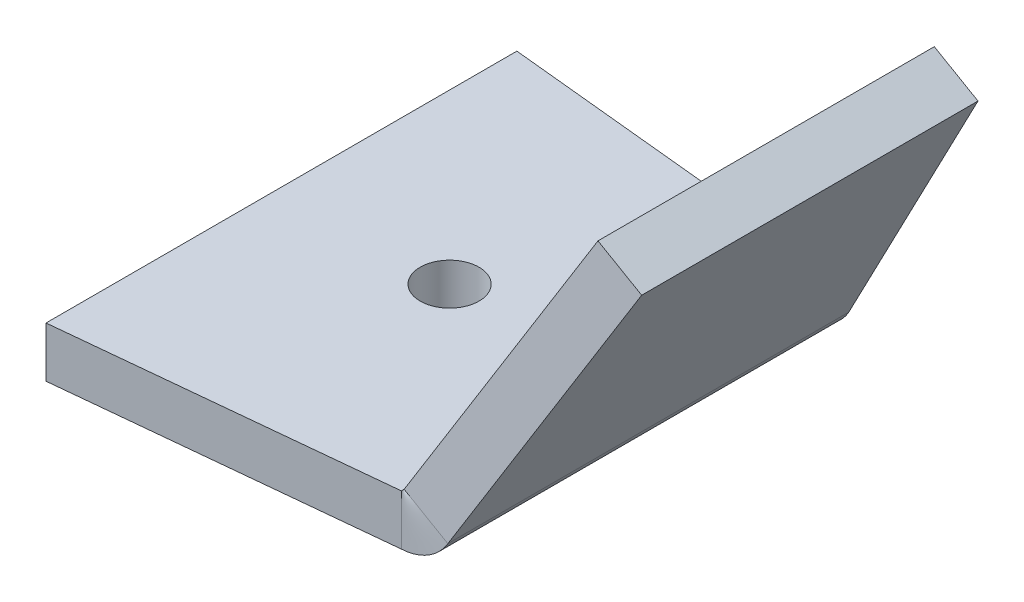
ISO-10303-21;
HEADER;
FILE_DESCRIPTION(('STEP AP214'),'2;1');
FILE_NAME('part.step','',(''),(''),'','','');
FILE_SCHEMA(('AUTOMOTIVE_DESIGN { 1 0 10303 214 1 1 1 1 }'));
ENDSEC;
DATA;
#1=APPLICATION_CONTEXT('core data for automotive mechanical design processes');
#2=APPLICATION_PROTOCOL_DEFINITION('international standard','automotive_design',2000,#1);
#3=PRODUCT_CONTEXT('',#1,'mechanical');
#4=PRODUCT('Part','Part','',(#3));
#5=PRODUCT_RELATED_PRODUCT_CATEGORY('part','',(#4));
#6=PRODUCT_DEFINITION_FORMATION('','',#4);
#7=PRODUCT_DEFINITION_CONTEXT('part definition',#1,'design');
#8=PRODUCT_DEFINITION('design','',#6,#7);
#9=PRODUCT_DEFINITION_SHAPE('','',#8);
#10=(LENGTH_UNIT() NAMED_UNIT(*) SI_UNIT(.MILLI.,.METRE.));
#11=(NAMED_UNIT(*) PLANE_ANGLE_UNIT() SI_UNIT($,.RADIAN.));
#12=(NAMED_UNIT(*) SI_UNIT($,.STERADIAN.) SOLID_ANGLE_UNIT());
#13=UNCERTAINTY_MEASURE_WITH_UNIT(LENGTH_MEASURE(1.E-05),#10,'distance_accuracy_value','');
#14=(GEOMETRIC_REPRESENTATION_CONTEXT(3) GLOBAL_UNCERTAINTY_ASSIGNED_CONTEXT((#13)) GLOBAL_UNIT_ASSIGNED_CONTEXT((#10,
#11,#12)) REPRESENTATION_CONTEXT('',''));
#15=CARTESIAN_POINT('',(0.,0.,0.));
#16=DIRECTION('',(0.,0.,1.));
#17=DIRECTION('',(1.,0.,0.));
#18=AXIS2_PLACEMENT_3D('',#15,#16,#17);
#19=CARTESIAN_POINT('',(28.8227090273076,19.6407988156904,-10.));
#20=DIRECTION('',(-0.0497518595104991,-0.0861727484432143,0.995037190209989));
#21=DIRECTION('',(0.497518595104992,0.861727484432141,0.0995037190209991));
#22=AXIS2_PLACEMENT_3D('',#19,#20,#21);
#23=PLANE('',#22);
#24=DIRECTION('',(-0.497518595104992,-0.861727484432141,-0.0995037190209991));
#25=VECTOR('',#24,1.);
#26=CARTESIAN_POINT('',(31.420785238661,18.1407988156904,-10.));
#27=LINE('',#26,#25);
#28=CARTESIAN_POINT('',(31.420785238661,18.1407988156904,-10.));
#29=VERTEX_POINT('',#28);
#30=CARTESIAN_POINT('',(21.8161023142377,1.50500000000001,-11.9209365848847));
#31=VERTEX_POINT('',#30);
#32=EDGE_CURVE('E76',#29,#31,#27,.T.);
#33=ORIENTED_EDGE('',*,*,#32,.T.);
#34=CARTESIAN_POINT('',(19.2180261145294,3.00499999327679,-11.9209365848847));
#35=CARTESIAN_POINT('',(21.8161023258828,1.50499999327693,-11.9209365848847));
#36=B_SPLINE_CURVE_WITH_KNOTS('',1,(#34,#35),.UNSPECIFIED.,.F.,.F.,(2,2),(0.,1.),.UNSPECIFIED.);
#37=CARTESIAN_POINT('',(19.2180261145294,3.00499999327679,-11.9209365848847));
#38=VERTEX_POINT('',#37);
#39=EDGE_CURVE('E268',#31,#38,#36,.F.);
#40=ORIENTED_EDGE('',*,*,#39,.T.);
#41=DIRECTION('',(-0.497518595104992,-0.861727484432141,-0.0995037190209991));
#42=VECTOR('',#41,1.);
#43=CARTESIAN_POINT('',(28.8227090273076,19.6407988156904,-10.));
#44=LINE('',#43,#42);
#45=CARTESIAN_POINT('',(28.8227090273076,19.6407988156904,-10.));
#46=VERTEX_POINT('',#45);
#47=EDGE_CURVE('E287',#46,#38,#44,.T.);
#48=ORIENTED_EDGE('',*,*,#47,.F.);
#49=DIRECTION('',(0.86602540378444,-0.499999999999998,0.));
#50=VECTOR('',#49,1.);
#51=CARTESIAN_POINT('',(28.8227090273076,19.6407988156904,-10.));
#52=LINE('',#51,#50);
#53=EDGE_CURVE('E295',#46,#29,#52,.T.);
#54=ORIENTED_EDGE('',*,*,#53,.T.);
#55=EDGE_LOOP('',(#33,#40,#48,#54));
#56=FACE_BOUND('',#55,.T.);
#57=ADVANCED_FACE('F50',(#56),#23,.F.);
#58=CARTESIAN_POINT('',(28.8227090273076,19.6407988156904,10.));
#59=DIRECTION('',(-0.0497518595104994,-0.0861727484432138,-0.995037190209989));
#60=DIRECTION('',(-0.497518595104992,-0.861727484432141,0.0995037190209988));
#61=AXIS2_PLACEMENT_3D('',#58,#59,#60);
#62=PLANE('',#61);
#63=DIRECTION('',(0.497518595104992,0.861727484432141,-0.0995037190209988));
#64=VECTOR('',#63,1.);
#65=CARTESIAN_POINT('',(28.8227090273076,19.6407988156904,10.));
#66=LINE('',#65,#64);
#67=CARTESIAN_POINT('',(19.2180261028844,3.005,11.9209365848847));
#68=VERTEX_POINT('',#67);
#69=CARTESIAN_POINT('',(28.8227090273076,19.6407988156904,10.));
#70=VERTEX_POINT('',#69);
#71=EDGE_CURVE('E283',#68,#70,#66,.T.);
#72=ORIENTED_EDGE('',*,*,#71,.F.);
#73=CARTESIAN_POINT('',(21.8161023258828,1.50499999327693,11.9209365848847));
#74=CARTESIAN_POINT('',(19.2180261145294,3.00499999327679,11.9209365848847));
#75=B_SPLINE_CURVE_WITH_KNOTS('',1,(#73,#74),.UNSPECIFIED.,.F.,.F.,(2,2),(0.,1.),.UNSPECIFIED.);
#76=CARTESIAN_POINT('',(21.8161023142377,1.505,11.9209365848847));
#77=VERTEX_POINT('',#76);
#78=EDGE_CURVE('E12',#68,#77,#75,.F.);
#79=ORIENTED_EDGE('',*,*,#78,.T.);
#80=DIRECTION('',(0.497518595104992,0.861727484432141,-0.0995037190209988));
#81=VECTOR('',#80,1.);
#82=CARTESIAN_POINT('',(31.420785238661,18.1407988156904,10.));
#83=LINE('',#82,#81);
#84=CARTESIAN_POINT('',(31.420785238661,18.1407988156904,10.));
#85=VERTEX_POINT('',#84);
#86=EDGE_CURVE('E69',#77,#85,#83,.T.);
#87=ORIENTED_EDGE('',*,*,#86,.T.);
#88=DIRECTION('',(0.86602540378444,-0.499999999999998,0.));
#89=VECTOR('',#88,1.);
#90=CARTESIAN_POINT('',(28.8227090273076,19.6407988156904,10.));
#91=LINE('',#90,#89);
#92=EDGE_CURVE('E297',#70,#85,#91,.T.);
#93=ORIENTED_EDGE('',*,*,#92,.F.);
#94=EDGE_LOOP('',(#72,#79,#87,#93));
#95=FACE_BOUND('',#94,.T.);
#96=ADVANCED_FACE('F52',(#95),#62,.F.);
#97=CARTESIAN_POINT('',(11.4207852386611,-16.5002173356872,14.));
#98=DIRECTION('',(-0.86602540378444,0.499999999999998,0.));
#99=DIRECTION('',(0.,0.,1.));
#100=AXIS2_PLACEMENT_3D('',#97,#98,#99);
#101=PLANE('',#100);
#102=ORIENTED_EDGE('',*,*,#86,.F.);
#103=DIRECTION('',(0.,0.,-1.));
#104=VECTOR('',#103,1.);
#105=CARTESIAN_POINT('',(21.8161023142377,1.50500000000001,14.));
#106=LINE('',#105,#104);
#107=EDGE_CURVE('E62',#77,#31,#106,.T.);
#108=ORIENTED_EDGE('',*,*,#107,.T.);
#109=ORIENTED_EDGE('',*,*,#32,.F.);
#110=DIRECTION('',(0.,0.,-1.));
#111=VECTOR('',#110,1.);
#112=CARTESIAN_POINT('',(31.420785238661,18.1407988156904,10.));
#113=LINE('',#112,#111);
#114=EDGE_CURVE('E278',#85,#29,#113,.T.);
#115=ORIENTED_EDGE('',*,*,#114,.F.);
#116=EDGE_LOOP('',(#102,#108,#109,#115));
#117=FACE_BOUND('',#116,.T.);
#118=ADVANCED_FACE('F314',(#117),#101,.F.);
#119=CARTESIAN_POINT('',(8.82270902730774,-15.0002173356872,14.));
#120=DIRECTION('',(-0.86602540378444,0.499999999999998,0.));
#121=DIRECTION('',(0.,0.,1.));
#122=AXIS2_PLACEMENT_3D('',#119,#120,#121);
#123=PLANE('',#122);
#124=DIRECTION('',(0.,0.,-1.));
#125=VECTOR('',#124,1.);
#126=CARTESIAN_POINT('',(19.2180261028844,3.005,14.));
#127=LINE('',#126,#125);
#128=EDGE_CURVE('E161',#68,#38,#127,.T.);
#129=ORIENTED_EDGE('',*,*,#128,.F.);
#130=ORIENTED_EDGE('',*,*,#71,.T.);
#131=DIRECTION('',(0.,0.,-1.));
#132=VECTOR('',#131,1.);
#133=CARTESIAN_POINT('',(28.8227090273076,19.6407988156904,10.));
#134=LINE('',#133,#132);
#135=EDGE_CURVE('E293',#70,#46,#134,.T.);
#136=ORIENTED_EDGE('',*,*,#135,.T.);
#137=ORIENTED_EDGE('',*,*,#47,.T.);
#138=EDGE_LOOP('',(#129,#130,#136,#137));
#139=FACE_BOUND('',#138,.T.);
#140=ADVANCED_FACE('F290',(#139),#123,.T.);
#141=CARTESIAN_POINT('',(28.8227090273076,19.6407988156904,10.));
#142=DIRECTION('',(-0.499999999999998,-0.86602540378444,0.));
#143=DIRECTION('',(0.,0.,1.));
#144=AXIS2_PLACEMENT_3D('',#141,#142,#143);
#145=PLANE('',#144);
#146=ORIENTED_EDGE('',*,*,#114,.T.);
#147=ORIENTED_EDGE('',*,*,#53,.F.);
#148=ORIENTED_EDGE('',*,*,#135,.F.);
#149=ORIENTED_EDGE('',*,*,#92,.T.);
#150=EDGE_LOOP('',(#146,#147,#148,#149));
#151=FACE_BOUND('',#150,.T.);
#152=ADVANCED_FACE('F313',(#151),#145,.F.);
#153=CARTESIAN_POINT('',(0.,3.,-14.));
#154=DIRECTION('',(1.,0.,0.));
#155=DIRECTION('',(0.,0.,-1.));
#156=AXIS2_PLACEMENT_3D('',#153,#154,#155);
#157=PLANE('',#156);
#158=DIRECTION('',(0.,0.,1.));
#159=VECTOR('',#158,1.);
#160=CARTESIAN_POINT('',(0.,0.,-14.));
#161=LINE('',#160,#159);
#162=CARTESIAN_POINT('',(0.,0.,-14.));
#163=VERTEX_POINT('',#162);
#164=CARTESIAN_POINT('',(0.,0.,14.));
#165=VERTEX_POINT('',#164);
#166=EDGE_CURVE('E154',#163,#165,#161,.T.);
#167=ORIENTED_EDGE('',*,*,#166,.T.);
#168=DIRECTION('',(0.,-1.,0.));
#169=VECTOR('',#168,1.);
#170=CARTESIAN_POINT('',(0.,3.,14.));
#171=LINE('',#170,#169);
#172=CARTESIAN_POINT('',(0.,3.,14.));
#173=VERTEX_POINT('',#172);
#174=EDGE_CURVE('E484',#173,#165,#171,.T.);
#175=ORIENTED_EDGE('',*,*,#174,.F.);
#176=DIRECTION('',(0.,0.,1.));
#177=VECTOR('',#176,1.);
#178=CARTESIAN_POINT('',(0.,3.,-14.));
#179=LINE('',#178,#177);
#180=CARTESIAN_POINT('',(0.,3.,-14.));
#181=VERTEX_POINT('',#180);
#182=EDGE_CURVE('E130',#181,#173,#179,.T.);
#183=ORIENTED_EDGE('',*,*,#182,.F.);
#184=DIRECTION('',(0.,-1.,0.));
#185=VECTOR('',#184,1.);
#186=CARTESIAN_POINT('',(0.,3.,-14.));
#187=LINE('',#186,#185);
#188=EDGE_CURVE('E127',#181,#163,#187,.T.);
#189=ORIENTED_EDGE('',*,*,#188,.T.);
#190=EDGE_LOOP('',(#167,#175,#183,#189));
#191=FACE_BOUND('',#190,.T.);
#192=ADVANCED_FACE('F338',(#191),#157,.F.);
#193=CARTESIAN_POINT('',(10.,3.,0.));
#194=DIRECTION('',(0.,-1.,0.));
#195=DIRECTION('',(0.,0.,-1.));
#196=AXIS2_PLACEMENT_3D('',#193,#194,#195);
#197=CYLINDRICAL_SURFACE('',#196,1.75);
#198=CARTESIAN_POINT('',(10.,3.,0.));
#199=DIRECTION('',(0.,1.,0.));
#200=DIRECTION('',(0.,0.,1.));
#201=AXIS2_PLACEMENT_3D('',#198,#199,#200);
#202=CIRCLE('',#201,1.75);
#203=CARTESIAN_POINT('',(10.,3.,1.75));
#204=VERTEX_POINT('',#203);
#205=EDGE_CURVE('E320',#204,#204,#202,.T.);
#206=ORIENTED_EDGE('',*,*,#205,.T.);
#207=EDGE_LOOP('',(#206));
#208=FACE_BOUND('',#207,.T.);
#209=CARTESIAN_POINT('',(10.,0.,0.));
#210=DIRECTION('',(0.,1.,0.));
#211=DIRECTION('',(0.,0.,1.));
#212=AXIS2_PLACEMENT_3D('',#209,#210,#211);
#213=CIRCLE('',#212,1.75);
#214=CARTESIAN_POINT('',(10.,0.,1.75));
#215=VERTEX_POINT('',#214);
#216=EDGE_CURVE('E482',#215,#215,#213,.T.);
#217=ORIENTED_EDGE('',*,*,#216,.F.);
#218=EDGE_LOOP('',(#217));
#219=FACE_BOUND('',#218,.T.);
#220=ADVANCED_FACE('F366',(#208,#219),#197,.F.);
#221=CARTESIAN_POINT('',(0.,3.,14.));
#222=DIRECTION('',(0.,1.,0.));
#223=DIRECTION('',(0.,0.,1.));
#224=AXIS2_PLACEMENT_3D('',#221,#222,#223);
#225=PLANE('',#224);
#226=ORIENTED_EDGE('',*,*,#205,.F.);
#227=EDGE_LOOP('',(#226));
#228=FACE_BOUND('',#227,.T.);
#229=DIRECTION('',(0.995037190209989,0.,-0.0995037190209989));
#230=VECTOR('',#229,1.);
#231=CARTESIAN_POINT('',(40.,3.,10.));
#232=LINE('',#231,#230);
#233=CARTESIAN_POINT('',(19.2093658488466,3.,12.0790634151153));
#234=VERTEX_POINT('',#233);
#235=EDGE_CURVE('E136',#173,#234,#232,.T.);
#236=ORIENTED_EDGE('',*,*,#235,.T.);
#237=DIRECTION('',(0.,0.,-1.));
#238=VECTOR('',#237,1.);
#239=CARTESIAN_POINT('',(19.2093658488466,3.,14.));
#240=LINE('',#239,#238);
#241=CARTESIAN_POINT('',(19.2093658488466,2.99999998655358,-12.0790634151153));
#242=VERTEX_POINT('',#241);
#243=EDGE_CURVE('E131',#234,#242,#240,.T.);
#244=ORIENTED_EDGE('',*,*,#243,.T.);
#245=DIRECTION('',(-0.995037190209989,0.,-0.0995037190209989));
#246=VECTOR('',#245,1.);
#247=CARTESIAN_POINT('',(40.,3.,-10.));
#248=LINE('',#247,#246);
#249=EDGE_CURVE('E119',#242,#181,#248,.T.);
#250=ORIENTED_EDGE('',*,*,#249,.T.);
#251=ORIENTED_EDGE('',*,*,#182,.T.);
#252=EDGE_LOOP('',(#236,#244,#250,#251));
#253=FACE_BOUND('',#252,.T.);
#254=ADVANCED_FACE('F134',(#228,#253),#225,.T.);
#255=CARTESIAN_POINT('',(40.,3.,-10.));
#256=DIRECTION('',(-0.0995037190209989,0.,0.995037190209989));
#257=DIRECTION('',(0.995037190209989,0.,0.0995037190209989));
#258=AXIS2_PLACEMENT_3D('',#255,#256,#257);
#259=PLANE('',#258);
#260=CARTESIAN_POINT('',(19.2093658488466,-1.34464227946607E-08,-12.0790634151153));
#261=CARTESIAN_POINT('',(19.2093658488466,2.99999998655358,-12.0790634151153));
#262=B_SPLINE_CURVE_WITH_KNOTS('',1,(#260,#261),.UNSPECIFIED.,.F.,.F.,(2,2),(0.,1.),.UNSPECIFIED.);
#263=CARTESIAN_POINT('',(19.2093658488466,0.,-12.0790634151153));
#264=VERTEX_POINT('',#263);
#265=EDGE_CURVE('E123',#264,#242,#262,.T.);
#266=ORIENTED_EDGE('',*,*,#265,.F.);
#267=DIRECTION('',(-0.995037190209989,0.,-0.0995037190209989));
#268=VECTOR('',#267,1.);
#269=CARTESIAN_POINT('',(40.,0.,-10.));
#270=LINE('',#269,#268);
#271=EDGE_CURVE('E485',#264,#163,#270,.T.);
#272=ORIENTED_EDGE('',*,*,#271,.T.);
#273=ORIENTED_EDGE('',*,*,#188,.F.);
#274=ORIENTED_EDGE('',*,*,#249,.F.);
#275=EDGE_LOOP('',(#266,#272,#273,#274));
#276=FACE_BOUND('',#275,.T.);
#277=ADVANCED_FACE('F121',(#276),#259,.F.);
#278=CARTESIAN_POINT('',(0.,0.,14.));
#279=DIRECTION('',(0.,1.,0.));
#280=DIRECTION('',(0.,0.,1.));
#281=AXIS2_PLACEMENT_3D('',#278,#279,#280);
#282=PLANE('',#281);
#283=DIRECTION('',(0.,0.,-1.));
#284=VECTOR('',#283,1.);
#285=CARTESIAN_POINT('',(19.2093658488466,0.,14.));
#286=LINE('',#285,#284);
#287=CARTESIAN_POINT('',(19.2093658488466,0.,12.0790634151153));
#288=VERTEX_POINT('',#287);
#289=EDGE_CURVE('E155',#288,#264,#286,.T.);
#290=ORIENTED_EDGE('',*,*,#289,.F.);
#291=DIRECTION('',(0.995037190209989,0.,-0.0995037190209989));
#292=VECTOR('',#291,1.);
#293=CARTESIAN_POINT('',(40.,0.,10.));
#294=LINE('',#293,#292);
#295=EDGE_CURVE('E279',#165,#288,#294,.T.);
#296=ORIENTED_EDGE('',*,*,#295,.F.);
#297=ORIENTED_EDGE('',*,*,#166,.F.);
#298=ORIENTED_EDGE('',*,*,#271,.F.);
#299=EDGE_LOOP('',(#290,#296,#297,#298));
#300=FACE_BOUND('',#299,.T.);
#301=ORIENTED_EDGE('',*,*,#216,.T.);
#302=EDGE_LOOP('',(#301));
#303=FACE_BOUND('',#302,.T.);
#304=ADVANCED_FACE('F334',(#300,#303),#282,.F.);
#305=CARTESIAN_POINT('',(40.,3.,10.));
#306=DIRECTION('',(-0.0995037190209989,0.,-0.995037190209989));
#307=DIRECTION('',(-0.995037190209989,0.,0.0995037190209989));
#308=AXIS2_PLACEMENT_3D('',#305,#306,#307);
#309=PLANE('',#308);
#310=CARTESIAN_POINT('',(19.2093658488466,2.99999998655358,12.0790634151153));
#311=CARTESIAN_POINT('',(19.2093658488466,-1.34464227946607E-08,12.0790634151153));
#312=B_SPLINE_CURVE_WITH_KNOTS('',1,(#310,#311),.UNSPECIFIED.,.F.,.F.,(2,2),(0.,1.),.UNSPECIFIED.);
#313=EDGE_CURVE('E163',#234,#288,#312,.T.);
#314=ORIENTED_EDGE('',*,*,#313,.F.);
#315=ORIENTED_EDGE('',*,*,#235,.F.);
#316=ORIENTED_EDGE('',*,*,#174,.T.);
#317=ORIENTED_EDGE('',*,*,#295,.T.);
#318=EDGE_LOOP('',(#314,#315,#316,#317));
#319=FACE_BOUND('',#318,.T.);
#320=ADVANCED_FACE('F220',(#319),#309,.F.);
#321=CARTESIAN_POINT('',(19.2093658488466,-1.34464227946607E-08,12.0790634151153));
#322=CARTESIAN_POINT('',(19.735006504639,-1.34464227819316E-08,12.05269406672));
#323=CARTESIAN_POINT('',(20.2594045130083,0.140591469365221,12.0263544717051));
#324=CARTESIAN_POINT('',(21.1693271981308,0.665935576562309,11.9736455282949));
#325=CARTESIAN_POINT('',(21.5532819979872,1.04978183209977,11.94730593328));
#326=CARTESIAN_POINT('',(21.8161023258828,1.50499999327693,11.9209365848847));
#327=CARTESIAN_POINT('',(19.2093658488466,2.99999998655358,12.0790634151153));
#328=CARTESIAN_POINT('',(19.2111111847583,2.99999998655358,12.0527088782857));
#329=CARTESIAN_POINT('',(19.2128543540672,3.00046706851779,12.0263544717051));
#330=CARTESIAN_POINT('',(19.2158773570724,3.00221240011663,11.9736455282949));
#331=CARTESIAN_POINT('',(19.2171534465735,3.0034884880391,11.9472911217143));
#332=CARTESIAN_POINT('',(19.2180261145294,3.00499999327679,11.9209365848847));
#333=B_SPLINE_SURFACE_WITH_KNOTS('',1,3,((#321,#322,#323,#324,#325,#326),(#327,#328,#329,#330,
#331,#332)),.UNSPECIFIED.,.F.,.F.,.F.,(2,2),(4,2,4),(0.,1.),(0.,0.5,1.),.UNSPECIFIED.);
#334=CARTESIAN_POINT('',(19.2093658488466,-1.34464227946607E-08,12.0790634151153));
#335=CARTESIAN_POINT('',(19.735006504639,-1.34464227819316E-08,12.05269406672));
#336=CARTESIAN_POINT('',(20.2594045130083,0.140591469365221,12.0263544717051));
#337=CARTESIAN_POINT('',(21.1693271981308,0.665935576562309,11.9736455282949));
#338=CARTESIAN_POINT('',(21.5532819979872,1.04978183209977,11.94730593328));
#339=CARTESIAN_POINT('',(21.8161023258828,1.50499999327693,11.9209365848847));
#340=B_SPLINE_CURVE_WITH_KNOTS('',3,(#334,#335,#336,#337,#338,#339),.UNSPECIFIED.,.F.,.F.,(4,2,
4),(0.,0.5,1.),.UNSPECIFIED.);
#341=EDGE_CURVE('E253',#288,#77,#340,.T.);
#342=CARTESIAN_POINT('',(19.2180261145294,3.00499999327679,11.9209365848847));
#343=CARTESIAN_POINT('',(19.2171534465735,3.0034884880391,11.9472911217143));
#344=CARTESIAN_POINT('',(19.2158773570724,3.00221240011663,11.9736455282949));
#345=CARTESIAN_POINT('',(19.2128543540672,3.00046706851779,12.0263544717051));
#346=CARTESIAN_POINT('',(19.2111111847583,2.99999998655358,12.0527088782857));
#347=CARTESIAN_POINT('',(19.2093658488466,2.99999998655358,12.0790634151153));
#348=B_SPLINE_CURVE_WITH_KNOTS('',3,(#342,#343,#344,#345,#346,#347),.UNSPECIFIED.,.F.,.F.,(4,2,
4),(0.,0.5,1.),.UNSPECIFIED.);
#349=EDGE_CURVE('E164',#234,#68,#348,.F.);
#350=ORIENTED_EDGE('',*,*,#313,.T.);
#351=ORIENTED_EDGE('',*,*,#341,.T.);
#352=ORIENTED_EDGE('',*,*,#78,.F.);
#353=ORIENTED_EDGE('',*,*,#349,.F.);
#354=EDGE_LOOP('',(#350,#351,#352,#353));
#355=FACE_BOUND('',#354,.T.);
#356=ADVANCED_FACE('F209',(#355),#333,.F.);
#357=CARTESIAN_POINT('',(21.8161023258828,1.50499999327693,-11.9209365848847));
#358=CARTESIAN_POINT('',(21.5532819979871,1.04978183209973,-11.94730593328));
#359=CARTESIAN_POINT('',(21.1693271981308,0.665935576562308,-11.9736455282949));
#360=CARTESIAN_POINT('',(20.2594045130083,0.140591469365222,-12.0263544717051));
#361=CARTESIAN_POINT('',(19.735006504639,-1.34464227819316E-08,-12.05269406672));
#362=CARTESIAN_POINT('',(19.2093658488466,-1.34464227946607E-08,-12.0790634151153));
#363=CARTESIAN_POINT('',(19.2180261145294,3.00499999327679,-11.9209365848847));
#364=CARTESIAN_POINT('',(19.2171534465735,3.0034884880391,-11.9472911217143));
#365=CARTESIAN_POINT('',(19.2158773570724,3.00221240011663,-11.9736455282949));
#366=CARTESIAN_POINT('',(19.2128543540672,3.00046706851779,-12.0263544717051));
#367=CARTESIAN_POINT('',(19.2111111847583,2.99999998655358,-12.0527088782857));
#368=CARTESIAN_POINT('',(19.2093658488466,2.99999998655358,-12.0790634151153));
#369=B_SPLINE_SURFACE_WITH_KNOTS('',1,3,((#357,#358,#359,#360,#361,#362),(#363,#364,#365,#366,
#367,#368)),.UNSPECIFIED.,.F.,.F.,.F.,(2,2),(4,2,4),(0.,1.),(0.,0.5,1.),.UNSPECIFIED.);
#370=CARTESIAN_POINT('',(21.8161023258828,1.50499999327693,-11.9209365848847));
#371=CARTESIAN_POINT('',(21.5532819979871,1.04978183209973,-11.94730593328));
#372=CARTESIAN_POINT('',(21.1693271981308,0.665935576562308,-11.9736455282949));
#373=CARTESIAN_POINT('',(20.2594045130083,0.140591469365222,-12.0263544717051));
#374=CARTESIAN_POINT('',(19.735006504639,-1.34464227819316E-08,-12.05269406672));
#375=CARTESIAN_POINT('',(19.2093658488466,-1.34464227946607E-08,-12.0790634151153));
#376=B_SPLINE_CURVE_WITH_KNOTS('',3,(#370,#371,#372,#373,#374,#375),.UNSPECIFIED.,.F.,.F.,(4,2,
4),(0.,0.5,1.),.UNSPECIFIED.);
#377=EDGE_CURVE('E152',#31,#264,#376,.T.);
#378=CARTESIAN_POINT('',(19.2093658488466,2.99999998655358,-12.0790634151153));
#379=CARTESIAN_POINT('',(19.2111111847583,2.99999998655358,-12.0527088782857));
#380=CARTESIAN_POINT('',(19.2128543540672,3.00046706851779,-12.0263544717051));
#381=CARTESIAN_POINT('',(19.2158773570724,3.00221240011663,-11.9736455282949));
#382=CARTESIAN_POINT('',(19.2171534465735,3.0034884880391,-11.9472911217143));
#383=CARTESIAN_POINT('',(19.2180261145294,3.00499999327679,-11.9209365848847));
#384=B_SPLINE_CURVE_WITH_KNOTS('',3,(#378,#379,#380,#381,#382,#383),.UNSPECIFIED.,.F.,.F.,(4,2,
4),(0.,0.5,1.),.UNSPECIFIED.);
#385=EDGE_CURVE('E149',#38,#242,#384,.F.);
#386=ORIENTED_EDGE('',*,*,#377,.T.);
#387=ORIENTED_EDGE('',*,*,#265,.T.);
#388=ORIENTED_EDGE('',*,*,#385,.F.);
#389=ORIENTED_EDGE('',*,*,#39,.F.);
#390=EDGE_LOOP('',(#386,#387,#388,#389));
#391=FACE_BOUND('',#390,.T.);
#392=ADVANCED_FACE('F147',(#391),#369,.F.);
#393=CARTESIAN_POINT('',(19.2093658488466,3.01,24.3949892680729));
#394=DIRECTION('',(0.,0.,-1.));
#395=DIRECTION('',(-1.,0.,0.));
#396=AXIS2_PLACEMENT_3D('',#393,#394,#395);
#397=CYLINDRICAL_SURFACE('',#396,0.0100000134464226);
#398=ORIENTED_EDGE('',*,*,#128,.T.);
#399=ORIENTED_EDGE('',*,*,#385,.T.);
#400=ORIENTED_EDGE('',*,*,#243,.F.);
#401=ORIENTED_EDGE('',*,*,#349,.T.);
#402=EDGE_LOOP('',(#398,#399,#400,#401));
#403=FACE_BOUND('',#402,.T.);
#404=ADVANCED_FACE('F160',(#403),#397,.F.);
#405=CARTESIAN_POINT('',(19.2093658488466,3.01,24.3949892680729));
#406=DIRECTION('',(0.,0.,-1.));
#407=DIRECTION('',(-1.,0.,0.));
#408=AXIS2_PLACEMENT_3D('',#405,#406,#407);
#409=CYLINDRICAL_SURFACE('',#408,3.01000001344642);
#410=ORIENTED_EDGE('',*,*,#107,.F.);
#411=ORIENTED_EDGE('',*,*,#341,.F.);
#412=ORIENTED_EDGE('',*,*,#289,.T.);
#413=ORIENTED_EDGE('',*,*,#377,.F.);
#414=EDGE_LOOP('',(#410,#411,#412,#413));
#415=FACE_BOUND('',#414,.T.);
#416=ADVANCED_FACE('F178',(#415),#409,.T.);
#417=CLOSED_SHELL('',(#57,#96,#118,#140,#152,#192,#220,#254,#277,#304,#320,#356,#392,#404,#416));
#418=MANIFOLD_SOLID_BREP('B2',#417);
#419=ADVANCED_BREP_SHAPE_REPRESENTATION('',(#18,#418),#14);
#420=SHAPE_DEFINITION_REPRESENTATION(#9,#419);
ENDSEC;
END-ISO-10303-21;
